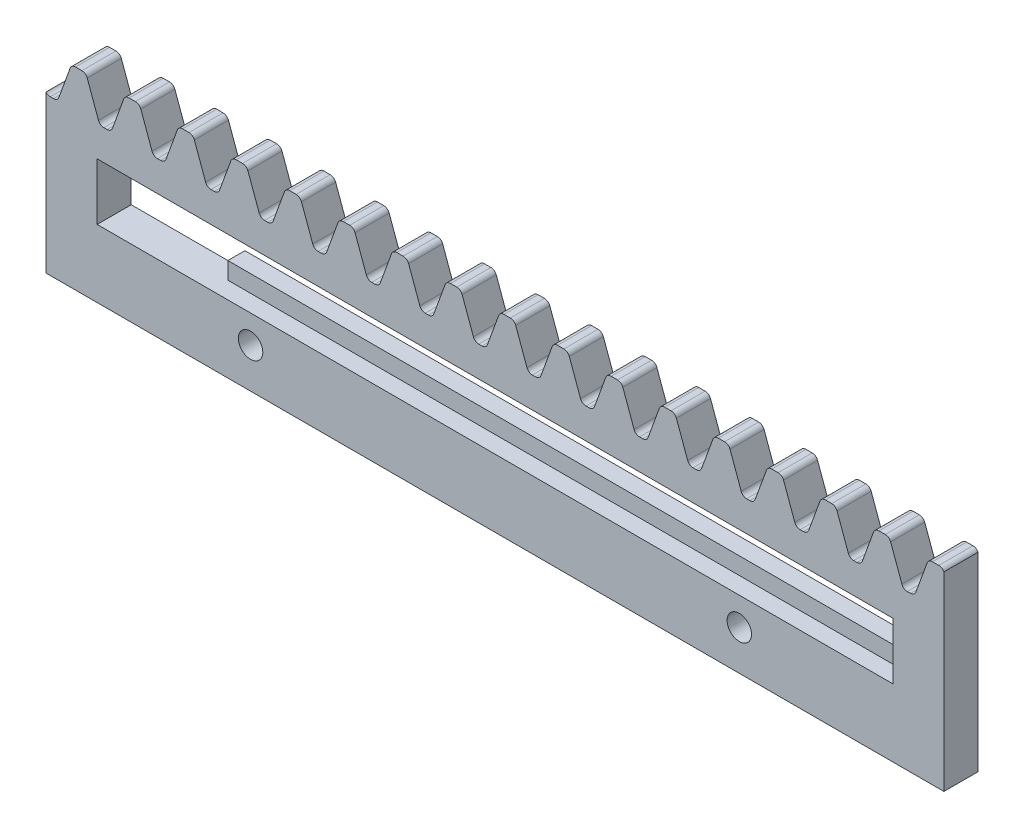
from build123d import *

# Parameters (mm, degrees)
BOSS_EXTRUDE1_DEPTH      = 7.5
BOSS_EXTRUDE1_DEPTH_BACK = 7.5
SKETCH3_W                = 100
SKETCH3_H                = 20
CUT_EXTRUDE1_DEPTH       = 52.53882032
LPATTERN1_COUNT          = 22
LPATTERN1_PITCH          = 4.71238898
LPATTERN1_COUNT_DIR2     = 2
LPATTERN1_PITCH_DIR2     = 4.71238898
CUT_EXTRUDE2_START       = 79
SKETCH5_W                = 20.617024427
SKETCH5_H                = 25.492672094
CUT_EXTRUDE2_DEPTH       = 25.07764064
CUT_EXTRUDE3_START       = -3
SKETCH6_W                = 97.166392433
SKETCH6_H                = 32.098590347
CUT_EXTRUDE3_DEPTH       = 51.150729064
SKETCH7_W                = 10
SKETCH7_H                = 2
SKETCH7_H_2              = 1.5
SKETCH7_W_2              = 60
CUT_EXTRUDE4_DEPTH       = 10
CUT_EXTRUDE5_START       = -3
SKETCH8_W                = 93.882938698
SKETCH8_H                = 17.449980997
CUT_EXTRUDE5_DEPTH       = 10
SKETCH9_R                = 1.075
CUT_EXTRUDE6_DEPTH       = 10
SKETCH10_W               = 70
SKETCH10_H               = 5
CUT_EXTRUDE7_DEPTH       = 1.5


with BuildPart() as part:
    # Sketch3 → Boss-Extrude1 (new, two sides: drawn at the far end of the back side and taken through both)
    with BuildSketch(Plane.XY.offset(-BOSS_EXTRUDE1_DEPTH_BACK)):
        Rectangle(SKETCH3_W, SKETCH3_H)
    extrude(amount=BOSS_EXTRUDE1_DEPTH + BOSS_EXTRUDE1_DEPTH_BACK)

    # Sketch4 → Cut-Extrude1 (cut, symmetric)
    with BuildSketch(Plane.XY):
        with BuildLine():
            Line((-47.876554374, 9.668866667), (-47.756031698, 10))
            Line((-47.756031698, 10), (-49.480084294, 10))
            Line((-49.480084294, 10), (-49.480084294, 6.625))
            Line((-49.480084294, 6.625), (-49.336815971, 6.625))
            ThreePointArc((-49.336815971, 6.625), (-49.048159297, 6.7160131), (-48.863908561, 6.956133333))
            Line((-48.863908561, 6.956133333), (-47.876554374, 9.668866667))
        make_face()
        with BuildLine():
            Line((-47.403646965, 10), (-47.756031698, 10))
            Line((-47.756031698, 10), (-47.876554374, 9.668866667))
            ThreePointArc((-47.876554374, 9.668866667), (-47.692303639, 9.9089869), (-47.403646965, 10))
        make_face()
        with BuildLine():
            Line((-46.371225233, 9.668866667), (-46.49174791, 10))
            Line((-46.49174791, 10), (-46.844132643, 10))
            ThreePointArc((-46.844132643, 10), (-46.555475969, 9.9089869), (-46.371225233, 9.668866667))
        make_face()
        with BuildLine():
            Line((-44.767695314, 6.625), (-44.767695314, 10))
            Line((-44.767695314, 10), (-46.49174791, 10))
            Line((-46.49174791, 10), (-46.371225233, 9.668866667))
            Line((-46.371225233, 9.668866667), (-45.383871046, 6.956133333))
            ThreePointArc((-45.383871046, 6.956133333), (-45.199620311, 6.7160131), (-44.910963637, 6.625))
            Line((-44.910963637, 6.625), (-44.767695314, 6.625))
        make_face()
    cut_extrude1 = extrude(amount=CUT_EXTRUDE1_DEPTH, both=True, mode=Mode.SUBTRACT)

    # LPattern1: Cut-Extrude1 22 × 2
    with Locations(*[Vector(1, 0, 0) * (i * LPATTERN1_PITCH) + Vector(-1, 0, 0) * (j * LPATTERN1_PITCH_DIR2) for i in range(LPATTERN1_COUNT) for j in range(LPATTERN1_COUNT_DIR2) if (i, j) != (0, 0)]):
        add(cut_extrude1, mode=Mode.SUBTRACT)

    # Sketch5 → Cut-Extrude2 (cut, through all)
    with BuildSketch(Plane(origin=(-50, -10, 7.5), x_dir=(0, 0, -1), z_dir=(1, 0, 0)).offset(CUT_EXTRUDE2_START)):
        with Locations((7.883086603, 9.59950037)):
            Rectangle(SKETCH5_W, SKETCH5_H)
    extrude(amount=CUT_EXTRUDE2_DEPTH, mode=Mode.SUBTRACT)

    # Sketch6 → Cut-Extrude3 (cut, through all)
    with BuildSketch(Plane.XY.offset(7.5).offset(CUT_EXTRUDE3_START)):
        with Locations((-11.264186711, -0.370249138)):
            Rectangle(SKETCH6_W, SKETCH6_H)
    extrude(amount=-CUT_EXTRUDE3_DEPTH, mode=Mode.SUBTRACT)

    # Sketch7 → Cut-Extrude4 (cut)
    with BuildSketch(Plane(origin=(0, 0, 4.5), x_dir=(-1, 0, 0), z_dir=(0, 0, -1))):
        with Locations((40.5, 1.456133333)):
            Rectangle(SKETCH7_W, SKETCH7_H)
        with Locations((40.5, -0.293866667)):
            Rectangle(SKETCH7_W, SKETCH7_H_2)
        with Locations((40.5, 3.206133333)):
            Rectangle(SKETCH7_W, SKETCH7_H_2)
        with Locations((5.5, 1.456133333)):
            Rectangle(SKETCH7_W_2, SKETCH7_H)
    extrude(amount=-CUT_EXTRUDE4_DEPTH, mode=Mode.SUBTRACT)

    # Sketch8 → Cut-Extrude5 (cut)
    with BuildSketch(Plane.XZ.offset(10).offset(CUT_EXTRUDE5_START)):
        with Locations((-8.05087986, 4.877486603)):
            Rectangle(SKETCH8_W, SKETCH8_H)
    extrude(amount=CUT_EXTRUDE5_DEPTH, mode=Mode.SUBTRACT)

    # Sketch9 → Cut-Extrude6 (cut)
    with BuildSketch(Plane(origin=(0, 0, 4.5), x_dir=(-1, 0, 0), z_dir=(0, 0, -1))):
        with Locations((-11, -3.5)):
            Circle(SKETCH9_R)
        with Locations(Location((32, -3.5, 0), (0, 0, 180))):
            Circle(SKETCH9_R)
    extrude(amount=-CUT_EXTRUDE6_DEPTH, mode=Mode.SUBTRACT)

    # Sketch10 → Cut-Extrude7 (cut)
    with BuildSketch(Plane.XY.offset(7.5)):
        with Locations((-10.5, 1.456133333)):
            Rectangle(SKETCH10_W, SKETCH10_H)
    extrude(amount=-CUT_EXTRUDE7_DEPTH, mode=Mode.SUBTRACT)


solid = part.part
